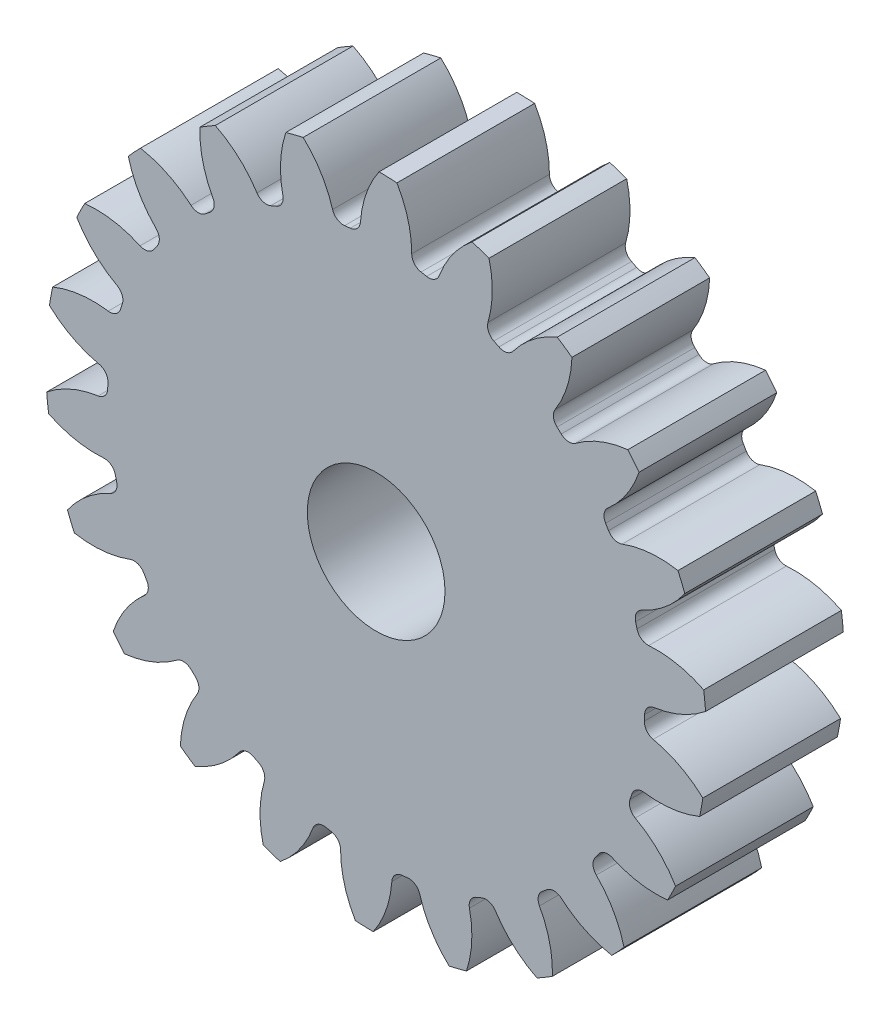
from build123d import *

# Parameters (mm, degrees)
SKETCH3_R         = 243.84
GEARBODY_DEPTH    = 101.6
TOOTHCUT_DEPTH    = 360.497498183
CIRPATTERN1_COUNT = 22
BOREDIA_R         = 50.8
BORE_DEPTH        = 12700


with BuildPart() as part:
    # Sketch3 → gearBody (new body)
    with BuildSketch(Plane.XY):
        Circle(SKETCH3_R)
    extrude(amount=GEARBODY_DEPTH)

    # Sketch2 → toothCut (cut, through all)
    with BuildSketch(Plane.XY):
        with BuildLine():
            ThreePointArc((197.905837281, -9.209450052), (197.992661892, -7.102129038), (198.057048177, -4.994003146))
            ThreePointArc((198.057048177, -4.994003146), (200.144191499, 0.292861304), (205.150664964, 2.98401838))
            ThreePointArc((205.150664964, 2.98401838), (225.674505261, 8.872576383), (243.84, 20.093892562))
            ThreePointArc((243.84, 20.093892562), (244.509273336, -8.770710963), (241.773595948, -37.51317663))
            ThreePointArc((241.773595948, -37.51317663), (224.458786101, -25.019158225), (204.409604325, -17.675218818))
            ThreePointArc((204.409604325, -17.675218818), (199.608817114, -14.632268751), (197.905837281, -9.209450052))
        make_face()
    toothcut = extrude(amount=TOOTHCUT_DEPTH, mode=Mode.SUBTRACT)

    # CirPattern1: toothCut ×22 about axis
    cirpattern1_axis = Axis((0, 0, 0), (0, 0, 1))
    for i in range(1, CIRPATTERN1_COUNT):
        add(toothcut.rotate(cirpattern1_axis, i * 360 / CIRPATTERN1_COUNT), mode=Mode.SUBTRACT)

    # boreDia → bore (cut, symmetric)
    with BuildSketch(Plane.XY):
        Circle(BOREDIA_R)
    extrude(amount=BORE_DEPTH, both=True, mode=Mode.SUBTRACT)


solid = part.part
